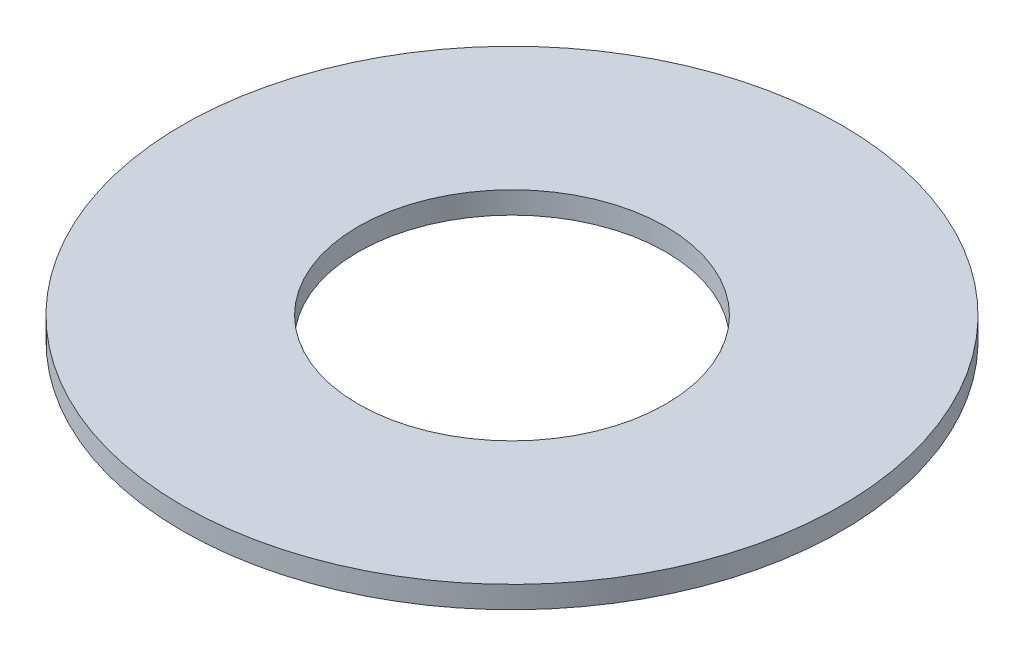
from build123d import *

# Parameters (mm, degrees)
ESQUISSE1_R      = 15
ESQUISSE1_R_2    = 7
EXTRUSION1_DEPTH = 1


with BuildPart() as part:
    # Esquisse1 → Extrusion1 (new body)
    with BuildSketch(Plane(origin=(0, 0, 0), x_dir=(1, 0, 0), z_dir=(0, 1, 0))):
        with Locations(Location((0, 0, 0), (0, 0, 270))):
            Circle(ESQUISSE1_R)
        with Locations(Location((0, 0, 0), (0, 0, 270))):
            Circle(ESQUISSE1_R_2, mode=Mode.SUBTRACT)
    extrude(amount=EXTRUSION1_DEPTH)


solid = part.part
